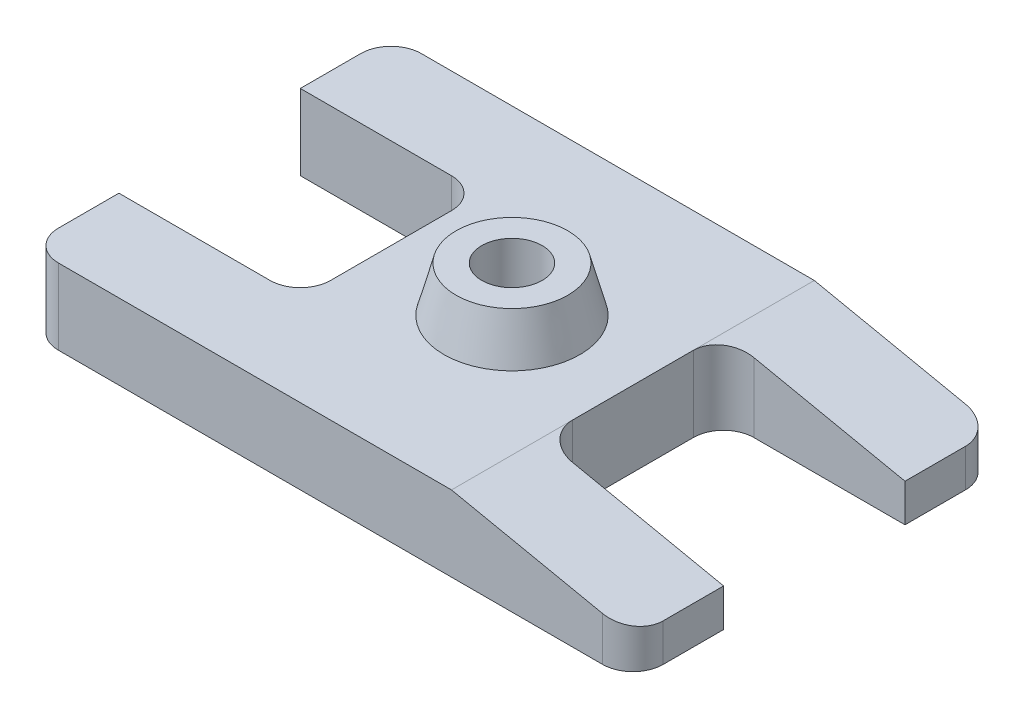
from build123d import *

# Parameters (mm, degrees)
SKETCH_1_W               = 200
SKETCH_1_H               = 120
EXTRUDE_1_DEPTH          = 25
CUT_EXTRUDE_1_DEPTH      = 159.192920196
CUT_EXTRUDE_1_DEPTH_BACK = 159.192920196
SKETCH_3_R               = 22.5
EXTRUDE_2_DEPTH          = 15
EXTRUDE_2_TAPER          = 15
SKETCH_4_W               = 60
SKETCH_4_H               = 60
CUT_EXTRUDE_3_DEPTH      = 124.288280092
SKETCH_5_R               = 10
CUT_EXTRUDE_5_DEPTH      = 124.288280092
FILLET_1_R               = 10


with BuildPart() as part:
    # Sketch 1 → Extrude 1 (new body)
    with BuildSketch(Plane(origin=(0, 0, 0), x_dir=(1, 0, 0), z_dir=(0, 1, 0))):
        Rectangle(SKETCH_1_W, SKETCH_1_H)
    extrude(amount=EXTRUDE_1_DEPTH)

    # Sketch 2 → Cut-Extrude 1 (cut, two sides: drawn at the far end of the back side and taken through both)
    with BuildSketch(Plane.XY.offset(60).offset(-CUT_EXTRUDE_1_DEPTH_BACK)):
        Polygon((-362.146055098, 108.780428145), (40, 25), (100, 12.5), (502.146055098, -71.280428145), (669.706911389, 733.01168205), (-194.585198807, 913.072538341), align=None)
    extrude(amount=CUT_EXTRUDE_1_DEPTH + CUT_EXTRUDE_1_DEPTH_BACK, mode=Mode.SUBTRACT)

    # Sketch 3 → Extrude 2 (add)
    with BuildSketch(Plane(origin=(0, 25, 0), x_dir=(1, 0, 0), z_dir=(0, 1, 0))):
        Circle(SKETCH_3_R)
    extrude(amount=EXTRUDE_2_DEPTH, taper=EXTRUDE_2_TAPER)

    # Sketch 4 → Cut-Extrude 3 (cut, through all)
    with BuildSketch(Plane(origin=(0, 0, 0), x_dir=(1, 0, 0), z_dir=(0, 1, 0))):
        with Locations((-70, 0)):
            Rectangle(SKETCH_4_W, SKETCH_4_H)
        with Locations((70, 0)):
            Rectangle(SKETCH_4_W, SKETCH_4_H)
    extrude(amount=CUT_EXTRUDE_3_DEPTH, mode=Mode.SUBTRACT)

    # Sketch 5 → Cut-Extrude 5 (cut, through all)
    with BuildSketch(Plane(origin=(0, 0, 0), x_dir=(1, 0, 0), z_dir=(0, 1, 0))):
        with Locations(Location((0, 0, 0), (0, 0, 270))):
            Circle(SKETCH_5_R)
    extrude(amount=CUT_EXTRUDE_5_DEPTH, mode=Mode.SUBTRACT)

    # Fillet 1
    fillet_1_edges = [part.edges().sort_by_distance(p)[0] for p in [
        (100, 6.25, 60),
        (100, 6.25, -60),
        (-40, 12.5, 30),
        (-40, 12.5, -30),
        (40, 12.5, -30),
        (40, 12.5, 30),
        (-100, 12.5, 60),
        (-100, 12.5, -60),
    ]]
    fillet(fillet_1_edges, radius=FILLET_1_R)


solid = part.part
